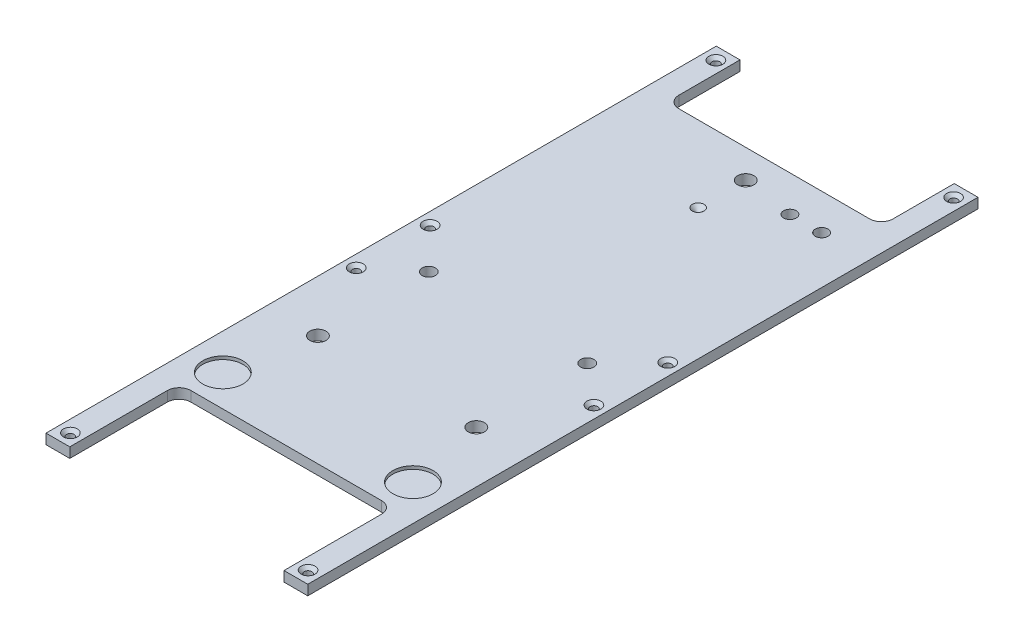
from build123d import *

# Parameters (mm, degrees)
SKETCH1_W                                       = 82.6
SKETCH1_H                                       = 154
PLATE_DEPTH                                     = 3.175
SKETCH32_W                                      = 7.5
SKETCH32_H                                      = 23
SKETCH32_H_2                                    = 34.5
BOSS_EXTRUDE3_DEPTH                             = 3.175
FILLET1_R                                       = 3.7
CSK_FOR_M2_FLAT_HEAD_MACHINE_SCREW1_D           = 2.4
CSK_FOR_M2_FLAT_HEAD_MACHINE_SCREW1_CSINK_D     = 4.4
CSK_FOR_M2_FLAT_HEAD_MACHINE_SCREW1_CSINK_ANGLE = 90
SKETCH17_R                                      = 6.35
FLATS_DEPTH                                     = 1
BOLT_HOLE_1_4_20_TAPPED_HOLE1_D                 = 5.1054
SPRING_HOLE_M5X0_8_TAPPED_HOLE1_D               = 4.2
CUT_EXTRUDE3_REACH                              = 171.635
SKETCH31_R                                      = 2


with BuildPart() as part:
    # Sketch1 → Plate (new body)
    with BuildSketch(Plane(origin=(0, 0, 0), x_dir=(1, 0, 0), z_dir=(0, 1, 0))):
        with Locations((0, -53)):
            Rectangle(SKETCH1_W, SKETCH1_H)
    extrude(amount=PLATE_DEPTH)

    # Sketch32 → Boss-Extrude3 (add)
    with BuildSketch(Plane.XZ):
        with Locations((-37.55, -35.5)):
            Rectangle(SKETCH32_W, SKETCH32_H)
        with Locations((37.55, -35.5)):
            Rectangle(SKETCH32_W, SKETCH32_H)
        with Locations((-37.55, 147.25)):
            Rectangle(SKETCH32_W, SKETCH32_H_2)
        with Locations((37.55, 147.25)):
            Rectangle(SKETCH32_W, SKETCH32_H_2)
    extrude(amount=-BOSS_EXTRUDE3_DEPTH)

    # Fillet1
    fillet1_edges = [part.edges().sort_by_distance(p)[0] for p in [
        (-33.8, 1.5875, -24),
        (33.8, 1.5875, -24),
        (33.8, 1.5875, 130),
        (-33.8, 1.5875, 130),
    ]]
    fillet(fillet1_edges, radius=FILLET1_R)

    # Sketch30 → Cone (revolve, cut)
    with BuildSketch(Plane.XY, mode=Mode.PRIVATE) as cone_sk:
        Polygon((0, 1.325), (1.85, 3.175), (0, 3.175), align=None)
    revolve(cone_sk.sketch.rotate(Axis((0, 3.175, 0), (0, -1, 0)), 180), axis=Axis((0, 3.175, 0), (0, -1, 0)), mode=Mode.SUBTRACT)

    # CSK for M2 Flat Head Machine Screw1 (through all)
    with Locations(Plane(origin=(0, 3.175, 0), x_dir=(1, 0, 0), z_dir=(0, 1, 0))):
        with Locations((-37.5, 43.1), (37.5, 43.1), (37.5, -47.1), (-37.5, -47.1), (-37.5, -70.4), (37.5, -70.4), (-37.5, -160.6), (37.5, -160.6)):
            CounterSinkHole(CSK_FOR_M2_FLAT_HEAD_MACHINE_SCREW1_D / 2, CSK_FOR_M2_FLAT_HEAD_MACHINE_SCREW1_CSINK_D / 2, counter_sink_angle=CSK_FOR_M2_FLAT_HEAD_MACHINE_SCREW1_CSINK_ANGLE)

    # Sketch17 → Flats (cut)
    with BuildSketch(Plane(origin=(0, 3.175, 0), x_dir=(1, 0, 0), z_dir=(0, 1, 0))):
        with Locations(Location((-30, -120, 0), (0, 0, 270))):
            Circle(SKETCH17_R)
        with Locations(Location((30, -120, 0), (0, 0, 270))):
            Circle(SKETCH17_R)
    extrude(amount=-FLATS_DEPTH, mode=Mode.SUBTRACT)

    # Bolt Hole 1_4-20 Tapped Hole1 (through all)
    with Locations(Plane(origin=(0, 3.175, 0), x_dir=(1, 0, 0), z_dir=(0, 1, 0))):
        with Locations((-25, -95), (25, -95), (0, 15)):
            Hole(BOLT_HOLE_1_4_20_TAPPED_HOLE1_D / 2)

    # Spring Hole M5x0.8 Tapped Hole1 (through all)
    with Locations(Plane(origin=(0, 3.175, 0), x_dir=(1, 0, 0), z_dir=(0, 1, 0))):
        with Locations((-25, -60), (25, -60)):
            Hole(SPRING_HOLE_M5X0_8_TAPPED_HOLE1_D / 2)

    # Sketch31 → Cut-Extrude3 (cut, up to next)
    with BuildSketch(Plane(origin=(0, 3.175, 0), x_dir=(1, 0, 0), z_dir=(0, 1, 0)), mode=Mode.PRIVATE) as cut_extrude3_sk1:
        with Locations(Location((26.3, 12.65, 0), (0, 0, 270))):
            Circle(SKETCH31_R)
    cut_extrude3_tool1 = extrude(cut_extrude3_sk1.sketch, amount=-CUT_EXTRUDE3_REACH, mode=Mode.PRIVATE) & part.part
    # Sketch31 → Cut-Extrude3 (cut, up to next)
    with BuildSketch(Plane(origin=(0, 3.175, 0), x_dir=(1, 0, 0), z_dir=(0, 1, 0)), mode=Mode.PRIVATE) as cut_extrude3_sk2:
        with Locations(Location((16.3, 12.65, 0), (0, 0, 270))):
            Circle(SKETCH31_R)
    cut_extrude3_tool2 = extrude(cut_extrude3_sk2.sketch, amount=-CUT_EXTRUDE3_REACH, mode=Mode.PRIVATE) & part.part
    add(cut_extrude3_tool1.solids().sort_by_distance((26.3, 3.175, -12.65))[0], mode=Mode.SUBTRACT)
    add(cut_extrude3_tool2.solids().sort_by_distance((16.3, 3.175, -12.65))[0], mode=Mode.SUBTRACT)


solid = part.part
